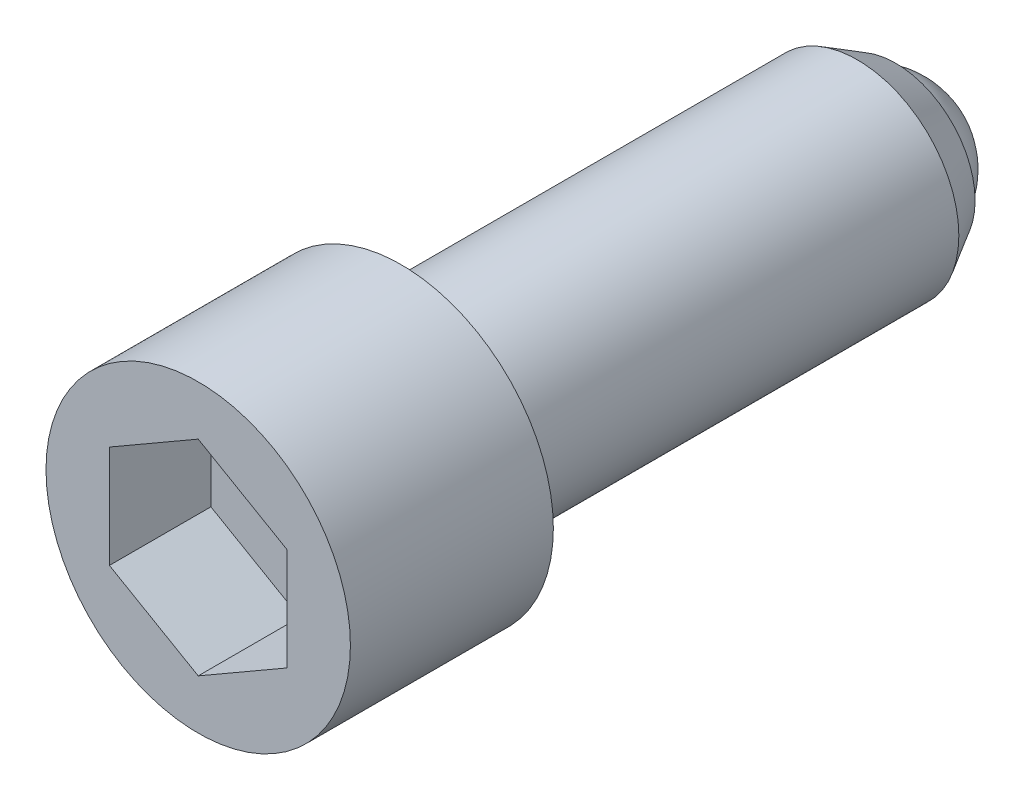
ISO-10303-21;
HEADER;
FILE_DESCRIPTION(('STEP AP214'),'2;1');
FILE_NAME('part.step','',(''),(''),'','','');
FILE_SCHEMA(('AUTOMOTIVE_DESIGN { 1 0 10303 214 1 1 1 1 }'));
ENDSEC;
DATA;
#1=APPLICATION_CONTEXT('core data for automotive mechanical design processes');
#2=APPLICATION_PROTOCOL_DEFINITION('international standard','automotive_design',2000,#1);
#3=PRODUCT_CONTEXT('',#1,'mechanical');
#4=PRODUCT('Part','Part','',(#3));
#5=PRODUCT_RELATED_PRODUCT_CATEGORY('part','',(#4));
#6=PRODUCT_DEFINITION_FORMATION('','',#4);
#7=PRODUCT_DEFINITION_CONTEXT('part definition',#1,'design');
#8=PRODUCT_DEFINITION('design','',#6,#7);
#9=PRODUCT_DEFINITION_SHAPE('','',#8);
#10=(LENGTH_UNIT() NAMED_UNIT(*) SI_UNIT(.MILLI.,.METRE.));
#11=(NAMED_UNIT(*) PLANE_ANGLE_UNIT() SI_UNIT($,.RADIAN.));
#12=(NAMED_UNIT(*) SI_UNIT($,.STERADIAN.) SOLID_ANGLE_UNIT());
#13=UNCERTAINTY_MEASURE_WITH_UNIT(LENGTH_MEASURE(1.E-05),#10,'distance_accuracy_value','');
#14=(GEOMETRIC_REPRESENTATION_CONTEXT(3) GLOBAL_UNCERTAINTY_ASSIGNED_CONTEXT((#13)) GLOBAL_UNIT_ASSIGNED_CONTEXT((#10,
#11,#12)) REPRESENTATION_CONTEXT('',''));
#15=CARTESIAN_POINT('',(0.,0.,0.));
#16=DIRECTION('',(0.,0.,1.));
#17=DIRECTION('',(1.,0.,0.));
#18=AXIS2_PLACEMENT_3D('',#15,#16,#17);
#19=CARTESIAN_POINT('',(0.,0.,4.));
#20=DIRECTION('',(0.,0.,1.));
#21=DIRECTION('',(-1.,0.,0.));
#22=AXIS2_PLACEMENT_3D('',#19,#20,#21);
#23=CONICAL_SURFACE('',#22,6.25,0.523598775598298);
#24=CARTESIAN_POINT('',(0.,0.,7.03108891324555));
#25=DIRECTION('',(0.,0.,-1.));
#26=DIRECTION('',(1.,0.,0.));
#27=AXIS2_PLACEMENT_3D('',#24,#25,#26);
#28=CIRCLE('',#27,8.);
#29=CARTESIAN_POINT('',(8.00000000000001,0.,7.03108891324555));
#30=VERTEX_POINT('',#29);
#31=EDGE_CURVE('E9',#30,#30,#28,.T.);
#32=ORIENTED_EDGE('',*,*,#31,.T.);
#33=EDGE_LOOP('',(#32));
#34=FACE_BOUND('',#33,.T.);
#35=CARTESIAN_POINT('',(0.,0.,4.));
#36=DIRECTION('',(0.,0.,-1.));
#37=DIRECTION('',(1.,0.,0.));
#38=AXIS2_PLACEMENT_3D('',#35,#36,#37);
#39=CIRCLE('',#38,6.25);
#40=CARTESIAN_POINT('',(6.25000000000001,0.,4.));
#41=VERTEX_POINT('',#40);
#42=EDGE_CURVE('E121',#41,#41,#39,.T.);
#43=ORIENTED_EDGE('',*,*,#42,.F.);
#44=EDGE_LOOP('',(#43));
#45=FACE_BOUND('',#44,.T.);
#46=ADVANCED_FACE('F14',(#34,#45),#23,.T.);
#47=CARTESIAN_POINT('',(0.,0.,-47.));
#48=DIRECTION('',(0.,0.,-1.));
#49=DIRECTION('',(1.,0.,0.));
#50=AXIS2_PLACEMENT_3D('',#47,#48,#49);
#51=CYLINDRICAL_SURFACE('',#50,8.);
#52=ORIENTED_EDGE('',*,*,#31,.F.);
#53=EDGE_LOOP('',(#52));
#54=FACE_BOUND('',#53,.T.);
#55=CARTESIAN_POINT('',(0.,0.,43.));
#56=DIRECTION('',(0.,0.,-1.));
#57=DIRECTION('',(1.,0.,0.));
#58=AXIS2_PLACEMENT_3D('',#55,#56,#57);
#59=CIRCLE('',#58,8.);
#60=CARTESIAN_POINT('',(8.00000000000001,0.,43.));
#61=VERTEX_POINT('',#60);
#62=EDGE_CURVE('E21',#61,#61,#59,.T.);
#63=ORIENTED_EDGE('',*,*,#62,.T.);
#64=EDGE_LOOP('',(#63));
#65=FACE_BOUND('',#64,.T.);
#66=ADVANCED_FACE('F135',(#54,#65),#51,.T.);
#67=CARTESIAN_POINT('',(8.,0.,43.));
#68=DIRECTION('',(0.,0.,-1.));
#69=DIRECTION('',(1.,0.,0.));
#70=AXIS2_PLACEMENT_3D('',#67,#68,#69);
#71=PLANE('',#70);
#72=CARTESIAN_POINT('',(0.,0.,43.));
#73=DIRECTION('',(0.,0.,-1.));
#74=DIRECTION('',(1.,0.,0.));
#75=AXIS2_PLACEMENT_3D('',#72,#73,#74);
#76=CIRCLE('',#75,12.);
#77=CARTESIAN_POINT('',(12.,0.,43.));
#78=VERTEX_POINT('',#77);
#79=EDGE_CURVE('E130',#78,#78,#76,.T.);
#80=ORIENTED_EDGE('',*,*,#79,.T.);
#81=EDGE_LOOP('',(#80));
#82=FACE_BOUND('',#81,.T.);
#83=ORIENTED_EDGE('',*,*,#62,.F.);
#84=EDGE_LOOP('',(#83));
#85=FACE_BOUND('',#84,.T.);
#86=ADVANCED_FACE('F137',(#82,#85),#71,.T.);
#87=CARTESIAN_POINT('',(0.,0.,-47.));
#88=DIRECTION('',(0.,0.,-1.));
#89=DIRECTION('',(1.,0.,0.));
#90=AXIS2_PLACEMENT_3D('',#87,#88,#89);
#91=CYLINDRICAL_SURFACE('',#90,12.);
#92=CARTESIAN_POINT('',(0.,0.,59.));
#93=DIRECTION('',(0.,0.,-1.));
#94=DIRECTION('',(1.,0.,0.));
#95=AXIS2_PLACEMENT_3D('',#92,#93,#94);
#96=CIRCLE('',#95,12.);
#97=CARTESIAN_POINT('',(12.,0.,59.));
#98=VERTEX_POINT('',#97);
#99=EDGE_CURVE('E127',#98,#98,#96,.T.);
#100=ORIENTED_EDGE('',*,*,#99,.T.);
#101=EDGE_LOOP('',(#100));
#102=FACE_BOUND('',#101,.T.);
#103=ORIENTED_EDGE('',*,*,#79,.F.);
#104=EDGE_LOOP('',(#103));
#105=FACE_BOUND('',#104,.T.);
#106=ADVANCED_FACE('F139',(#102,#105),#91,.T.);
#107=CARTESIAN_POINT('',(12.,0.,59.));
#108=DIRECTION('',(0.,0.,1.));
#109=DIRECTION('',(-1.,0.,0.));
#110=AXIS2_PLACEMENT_3D('',#107,#108,#109);
#111=PLANE('',#110);
#112=DIRECTION('',(-0.86602540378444,0.5,0.));
#113=VECTOR('',#112,1.);
#114=CARTESIAN_POINT('',(7.,4.04145188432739,59.));
#115=LINE('',#114,#113);
#116=CARTESIAN_POINT('',(7.,4.04145188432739,59.));
#117=VERTEX_POINT('',#116);
#118=CARTESIAN_POINT('',(0.,8.08290376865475,59.));
#119=VERTEX_POINT('',#118);
#120=EDGE_CURVE('E28',#117,#119,#115,.T.);
#121=ORIENTED_EDGE('',*,*,#120,.F.);
#122=DIRECTION('',(0.,1.,0.));
#123=VECTOR('',#122,1.);
#124=CARTESIAN_POINT('',(7.,-4.04145188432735,59.));
#125=LINE('',#124,#123);
#126=CARTESIAN_POINT('',(7.,-4.04145188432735,59.));
#127=VERTEX_POINT('',#126);
#128=EDGE_CURVE('E97',#127,#117,#125,.T.);
#129=ORIENTED_EDGE('',*,*,#128,.F.);
#130=DIRECTION('',(-0.866025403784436,-0.5,0.));
#131=VECTOR('',#130,1.);
#132=CARTESIAN_POINT('',(7.,-4.04145188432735,59.));
#133=LINE('',#132,#131);
#134=CARTESIAN_POINT('',(0.,-8.08290376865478,59.));
#135=VERTEX_POINT('',#134);
#136=EDGE_CURVE('E92',#127,#135,#133,.T.);
#137=ORIENTED_EDGE('',*,*,#136,.T.);
#138=DIRECTION('',(0.866025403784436,-0.5,0.));
#139=VECTOR('',#138,1.);
#140=CARTESIAN_POINT('',(-7.,-4.04145188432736,59.));
#141=LINE('',#140,#139);
#142=CARTESIAN_POINT('',(-7.,-4.04145188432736,59.));
#143=VERTEX_POINT('',#142);
#144=EDGE_CURVE('E90',#143,#135,#141,.T.);
#145=ORIENTED_EDGE('',*,*,#144,.F.);
#146=DIRECTION('',(0.,1.,0.));
#147=VECTOR('',#146,1.);
#148=CARTESIAN_POINT('',(-7.,-4.04145188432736,59.));
#149=LINE('',#148,#147);
#150=CARTESIAN_POINT('',(-7.,4.04145188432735,59.));
#151=VERTEX_POINT('',#150);
#152=EDGE_CURVE('E71',#143,#151,#149,.T.);
#153=ORIENTED_EDGE('',*,*,#152,.T.);
#154=DIRECTION('',(0.866025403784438,0.5,0.));
#155=VECTOR('',#154,1.);
#156=CARTESIAN_POINT('',(-7.,4.04145188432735,59.));
#157=LINE('',#156,#155);
#158=EDGE_CURVE('E82',#151,#119,#157,.T.);
#159=ORIENTED_EDGE('',*,*,#158,.T.);
#160=EDGE_LOOP('',(#121,#129,#137,#145,#153,#159));
#161=FACE_BOUND('',#160,.T.);
#162=ORIENTED_EDGE('',*,*,#99,.F.);
#163=EDGE_LOOP('',(#162));
#164=FACE_BOUND('',#163,.T.);
#165=ADVANCED_FACE('F86',(#161,#164),#111,.T.);
#166=CARTESIAN_POINT('',(0.,0.,6.));
#167=DIRECTION('',(0.,0.,-1.));
#168=DIRECTION('',(1.,0.,0.));
#169=AXIS2_PLACEMENT_3D('',#166,#167,#168);
#170=SPHERICAL_SURFACE('',#169,6.);
#171=CARTESIAN_POINT('',(0.,0.,4.));
#172=DIRECTION('',(0.,0.,-1.));
#173=DIRECTION('',(1.,0.,0.));
#174=AXIS2_PLACEMENT_3D('',#171,#172,#173);
#175=CIRCLE('',#174,5.65685424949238);
#176=CARTESIAN_POINT('',(5.65685424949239,0.,4.));
#177=VERTEX_POINT('',#176);
#178=EDGE_CURVE('E124',#177,#177,#175,.T.);
#179=ORIENTED_EDGE('',*,*,#178,.T.);
#180=EDGE_LOOP('',(#179));
#181=FACE_BOUND('',#180,.T.);
#182=ADVANCED_FACE('F161',(#181),#170,.T.);
#183=CARTESIAN_POINT('',(6.25,0.,4.));
#184=DIRECTION('',(0.,0.,1.));
#185=DIRECTION('',(-1.,0.,0.));
#186=AXIS2_PLACEMENT_3D('',#183,#184,#185);
#187=PLANE('',#186);
#188=ORIENTED_EDGE('',*,*,#178,.F.);
#189=EDGE_LOOP('',(#188));
#190=FACE_BOUND('',#189,.T.);
#191=ORIENTED_EDGE('',*,*,#42,.T.);
#192=EDGE_LOOP('',(#191));
#193=FACE_BOUND('',#192,.T.);
#194=ADVANCED_FACE('F158',(#190,#193),#187,.F.);
#195=CARTESIAN_POINT('',(7.,4.04145188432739,51.));
#196=DIRECTION('',(0.5,0.86602540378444,0.));
#197=DIRECTION('',(0.86602540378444,-0.5,0.));
#198=AXIS2_PLACEMENT_3D('',#195,#196,#197);
#199=PLANE('',#198);
#200=DIRECTION('',(0.,0.,1.));
#201=VECTOR('',#200,1.);
#202=CARTESIAN_POINT('',(7.,4.04145188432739,51.));
#203=LINE('',#202,#201);
#204=CARTESIAN_POINT('',(7.,4.04145188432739,51.));
#205=VERTEX_POINT('',#204);
#206=EDGE_CURVE('E35',#205,#117,#203,.T.);
#207=ORIENTED_EDGE('',*,*,#206,.T.);
#208=ORIENTED_EDGE('',*,*,#120,.T.);
#209=DIRECTION('',(0.,0.,1.));
#210=VECTOR('',#209,1.);
#211=CARTESIAN_POINT('',(0.,8.08290376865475,51.));
#212=LINE('',#211,#210);
#213=CARTESIAN_POINT('',(0.,8.08290376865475,51.));
#214=VERTEX_POINT('',#213);
#215=EDGE_CURVE('E79',#214,#119,#212,.T.);
#216=ORIENTED_EDGE('',*,*,#215,.F.);
#217=DIRECTION('',(-0.86602540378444,0.5,0.));
#218=VECTOR('',#217,1.);
#219=CARTESIAN_POINT('',(7.,4.04145188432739,51.));
#220=LINE('',#219,#218);
#221=EDGE_CURVE('E99',#205,#214,#220,.T.);
#222=ORIENTED_EDGE('',*,*,#221,.F.);
#223=EDGE_LOOP('',(#207,#208,#216,#222));
#224=FACE_BOUND('',#223,.T.);
#225=ADVANCED_FACE('F160',(#224),#199,.F.);
#226=CARTESIAN_POINT('',(7.,-4.04145188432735,51.));
#227=DIRECTION('',(1.,0.,0.));
#228=DIRECTION('',(0.,-1.,0.));
#229=AXIS2_PLACEMENT_3D('',#226,#227,#228);
#230=PLANE('',#229);
#231=DIRECTION('',(0.,0.,1.));
#232=VECTOR('',#231,1.);
#233=CARTESIAN_POINT('',(7.,-4.04145188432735,51.));
#234=LINE('',#233,#232);
#235=CARTESIAN_POINT('',(7.,-4.04145188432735,51.));
#236=VERTEX_POINT('',#235);
#237=EDGE_CURVE('E118',#236,#127,#234,.T.);
#238=ORIENTED_EDGE('',*,*,#237,.T.);
#239=ORIENTED_EDGE('',*,*,#128,.T.);
#240=ORIENTED_EDGE('',*,*,#206,.F.);
#241=DIRECTION('',(0.,1.,0.));
#242=VECTOR('',#241,1.);
#243=CARTESIAN_POINT('',(7.,-4.04145188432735,51.));
#244=LINE('',#243,#242);
#245=EDGE_CURVE('E111',#236,#205,#244,.T.);
#246=ORIENTED_EDGE('',*,*,#245,.F.);
#247=EDGE_LOOP('',(#238,#239,#240,#246));
#248=FACE_BOUND('',#247,.T.);
#249=ADVANCED_FACE('F168',(#248),#230,.F.);
#250=CARTESIAN_POINT('',(7.,-4.04145188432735,51.));
#251=DIRECTION('',(-0.5,0.866025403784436,0.));
#252=DIRECTION('',(0.866025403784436,0.5,0.));
#253=AXIS2_PLACEMENT_3D('',#250,#251,#252);
#254=PLANE('',#253);
#255=DIRECTION('',(0.,0.,1.));
#256=VECTOR('',#255,1.);
#257=CARTESIAN_POINT('',(0.,-8.08290376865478,51.));
#258=LINE('',#257,#256);
#259=CARTESIAN_POINT('',(0.,-8.08290376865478,51.));
#260=VERTEX_POINT('',#259);
#261=EDGE_CURVE('E116',#260,#135,#258,.T.);
#262=ORIENTED_EDGE('',*,*,#261,.T.);
#263=ORIENTED_EDGE('',*,*,#136,.F.);
#264=ORIENTED_EDGE('',*,*,#237,.F.);
#265=DIRECTION('',(-0.866025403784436,-0.5,0.));
#266=VECTOR('',#265,1.);
#267=CARTESIAN_POINT('',(7.,-4.04145188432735,51.));
#268=LINE('',#267,#266);
#269=EDGE_CURVE('E108',#236,#260,#268,.T.);
#270=ORIENTED_EDGE('',*,*,#269,.T.);
#271=EDGE_LOOP('',(#262,#263,#264,#270));
#272=FACE_BOUND('',#271,.T.);
#273=ADVANCED_FACE('F212',(#272),#254,.T.);
#274=CARTESIAN_POINT('',(-7.,-4.04145188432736,51.));
#275=DIRECTION('',(-0.5,-0.866025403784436,0.));
#276=DIRECTION('',(-0.866025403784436,0.5,0.));
#277=AXIS2_PLACEMENT_3D('',#274,#275,#276);
#278=PLANE('',#277);
#279=DIRECTION('',(0.,0.,1.));
#280=VECTOR('',#279,1.);
#281=CARTESIAN_POINT('',(-7.,-4.04145188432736,51.));
#282=LINE('',#281,#280);
#283=CARTESIAN_POINT('',(-7.,-4.04145188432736,51.));
#284=VERTEX_POINT('',#283);
#285=EDGE_CURVE('E78',#284,#143,#282,.T.);
#286=ORIENTED_EDGE('',*,*,#285,.T.);
#287=ORIENTED_EDGE('',*,*,#144,.T.);
#288=ORIENTED_EDGE('',*,*,#261,.F.);
#289=DIRECTION('',(0.866025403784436,-0.5,0.));
#290=VECTOR('',#289,1.);
#291=CARTESIAN_POINT('',(-7.,-4.04145188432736,51.));
#292=LINE('',#291,#290);
#293=EDGE_CURVE('E105',#284,#260,#292,.T.);
#294=ORIENTED_EDGE('',*,*,#293,.F.);
#295=EDGE_LOOP('',(#286,#287,#288,#294));
#296=FACE_BOUND('',#295,.T.);
#297=ADVANCED_FACE('F220',(#296),#278,.F.);
#298=CARTESIAN_POINT('',(-7.,-4.04145188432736,51.));
#299=DIRECTION('',(1.,0.,0.));
#300=DIRECTION('',(0.,-1.,0.));
#301=AXIS2_PLACEMENT_3D('',#298,#299,#300);
#302=PLANE('',#301);
#303=DIRECTION('',(0.,0.,1.));
#304=VECTOR('',#303,1.);
#305=CARTESIAN_POINT('',(-7.,4.04145188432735,51.));
#306=LINE('',#305,#304);
#307=CARTESIAN_POINT('',(-7.,4.04145188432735,51.));
#308=VERTEX_POINT('',#307);
#309=EDGE_CURVE('E67',#308,#151,#306,.T.);
#310=ORIENTED_EDGE('',*,*,#309,.T.);
#311=ORIENTED_EDGE('',*,*,#152,.F.);
#312=ORIENTED_EDGE('',*,*,#285,.F.);
#313=DIRECTION('',(0.,1.,0.));
#314=VECTOR('',#313,1.);
#315=CARTESIAN_POINT('',(-7.,-4.04145188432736,51.));
#316=LINE('',#315,#314);
#317=EDGE_CURVE('E74',#284,#308,#316,.T.);
#318=ORIENTED_EDGE('',*,*,#317,.T.);
#319=EDGE_LOOP('',(#310,#311,#312,#318));
#320=FACE_BOUND('',#319,.T.);
#321=ADVANCED_FACE('F69',(#320),#302,.T.);
#322=CARTESIAN_POINT('',(-7.,4.04145188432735,51.));
#323=DIRECTION('',(0.5,-0.866025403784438,0.));
#324=DIRECTION('',(-0.866025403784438,-0.5,0.));
#325=AXIS2_PLACEMENT_3D('',#322,#323,#324);
#326=PLANE('',#325);
#327=DIRECTION('',(0.866025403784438,0.5,0.));
#328=VECTOR('',#327,1.);
#329=CARTESIAN_POINT('',(-7.,4.04145188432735,51.));
#330=LINE('',#329,#328);
#331=EDGE_CURVE('E102',#308,#214,#330,.T.);
#332=ORIENTED_EDGE('',*,*,#331,.T.);
#333=ORIENTED_EDGE('',*,*,#215,.T.);
#334=ORIENTED_EDGE('',*,*,#158,.F.);
#335=ORIENTED_EDGE('',*,*,#309,.F.);
#336=EDGE_LOOP('',(#332,#333,#334,#335));
#337=FACE_BOUND('',#336,.T.);
#338=ADVANCED_FACE('F83',(#337),#326,.T.);
#339=CARTESIAN_POINT('',(14.,0.,51.));
#340=DIRECTION('',(0.,0.,1.));
#341=DIRECTION('',(-1.,0.,0.));
#342=AXIS2_PLACEMENT_3D('',#339,#340,#341);
#343=PLANE('',#342);
#344=ORIENTED_EDGE('',*,*,#221,.T.);
#345=ORIENTED_EDGE('',*,*,#331,.F.);
#346=ORIENTED_EDGE('',*,*,#317,.F.);
#347=ORIENTED_EDGE('',*,*,#293,.T.);
#348=ORIENTED_EDGE('',*,*,#269,.F.);
#349=ORIENTED_EDGE('',*,*,#245,.T.);
#350=EDGE_LOOP('',(#344,#345,#346,#347,#348,#349));
#351=FACE_BOUND('',#350,.T.);
#352=ADVANCED_FACE('F239',(#351),#343,.T.);
#353=CLOSED_SHELL('',(#46,#66,#86,#106,#165,#182,#194,#225,#249,#273,#297,#321,#338,#352));
#354=MANIFOLD_SOLID_BREP('B1',#353);
#355=ADVANCED_BREP_SHAPE_REPRESENTATION('',(#18,#354),#14);
#356=SHAPE_DEFINITION_REPRESENTATION(#9,#355);
ENDSEC;
END-ISO-10303-21;
